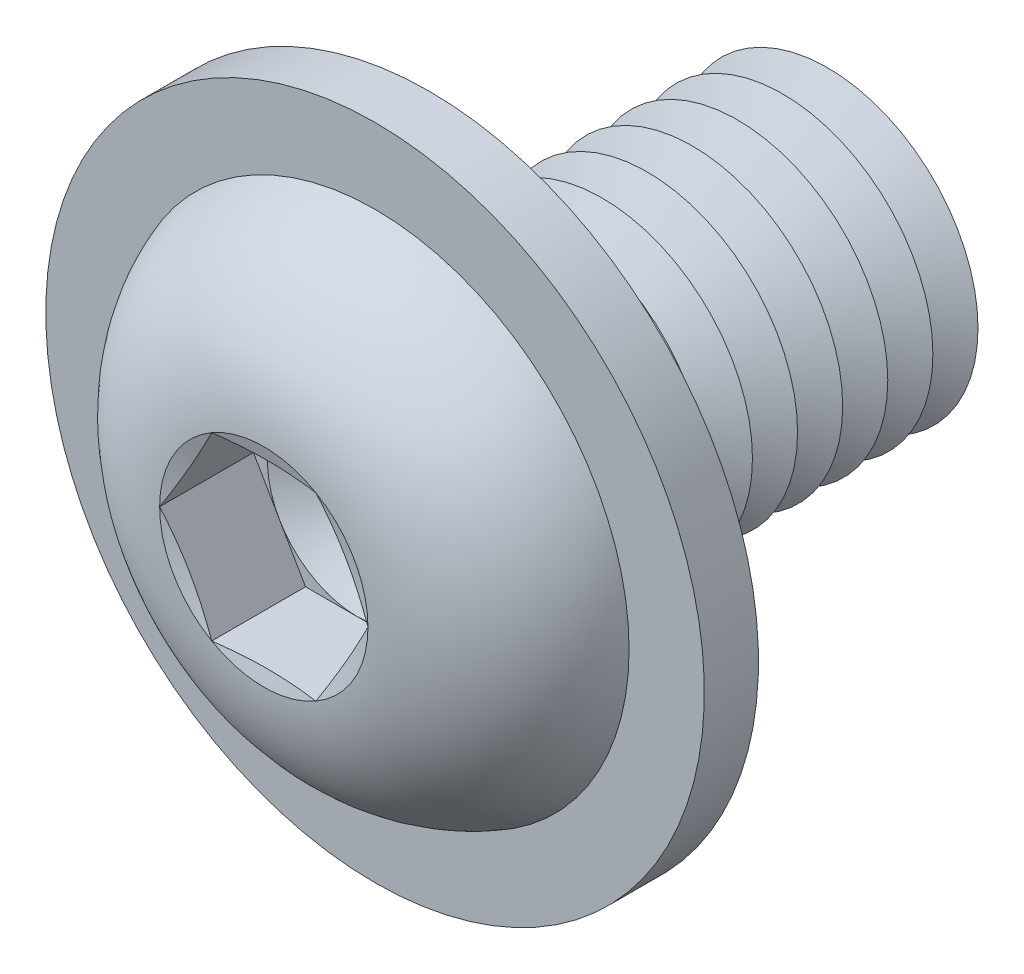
from build123d import *

# Parameters (mm, degrees)
FILLET1_R           = 0.75
LPATTERN1_COUNT     = 9
LPATTERN1_PITCH     = 1.5
CUT_EXTRUDE1_DEPTH  = 3.12
SKETCH5_R           = 10.95
SKETCH5_R_2         = 5.75
BOSS_EXTRUDE1_DEPTH = 1.8


with BuildPart() as part:
    # Sketch1 → Revolve1 (revolve)
    with BuildSketch(Plane(origin=(0, 0, 0), x_dir=(0, 0, -1), z_dir=(1, 0, 0)), mode=Mode.PRIVATE) as revolve1_sk:
        with BuildLine():
            Line((0, 5), (0, 8.75))
            ThreePointArc((0, 8.75), (-3.814142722, 7.21429474), (-5.5, 3.4641))
            Line((-5.5, 3.4641), (-5.035898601, 1.73205))
            Line((-5.035898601, 1.73205), (-5.5, 1.73205))
            Line((-5.5, 1.73205), (-5.5, 0))
            Line((-5.5, 0), (14, 0))
            Line((14, 0), (14, 5))
            Line((14, 5), (0, 5))
        make_face()
    revolve(revolve1_sk.sketch.rotate(Axis((0, 0, -14), (0, 0, 1)), 90), axis=Axis((0, 0, -14), (0, 0, 1)))

    # Fillet1
    fillet1_edges = [part.edges().sort_by_distance(p)[0] for p in [
        (5, 0, 0),
    ]]
    fillet(fillet1_edges, radius=FILLET1_R)

    # Sketch2 → Cut-Revolve1 (revolve, cut)
    with BuildSketch(Plane(origin=(0, 0, 0), x_dir=(0, 0, -1), z_dir=(1, 0, 0)), mode=Mode.PRIVATE) as cut_revolve1_sk:
        Polygon((13.25, 5), (14.75, 5), (14, 3.700961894), align=None)
    cut_revolve1 = revolve(cut_revolve1_sk.sketch.rotate(Axis((0, 0, -14), (0, 0, -1)), 270), axis=Axis((0, 0, -14), (0, 0, -1)), mode=Mode.SUBTRACT)

    # LPattern1: Cut-Revolve1 ×9
    with Locations(*[(0, 0, i * LPATTERN1_PITCH) for i in range(1, LPATTERN1_COUNT)]):
        add(cut_revolve1, mode=Mode.SUBTRACT)

    # Sketch3 → Cut-Extrude1 (cut)
    with BuildSketch(Plane.XY.offset(5.5)):
        Polygon((1.73205, 2.999998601), (-1.73205, 2.999998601), (-3.4641, 0), (-1.73205, -2.999998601), (1.73205, -2.999998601), (3.4641, 0), align=None)
    extrude(amount=-CUT_EXTRUDE1_DEPTH, mode=Mode.SUBTRACT)

    # Cut-Extrude2 cone 1 section (on through the dimple's axis) → Cut-Extrude2 (revolve, cut)
    with BuildSketch(Plane(origin=(0, 0, 2.38), x_dir=(0, -1, 0), z_dir=(1, 0, 0))):
        Polygon((0, 0), (2.999998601, 0), (0, 1.73205), align=None)
    revolve(axis=Axis((0, 0, 2.38), (0, 0, -1)), mode=Mode.SUBTRACT)

    # Sketch5 → Boss-Extrude1 (add)
    with BuildSketch(Plane(origin=(0, 0, 0), x_dir=(-1, 0, 0), z_dir=(0, 0, -1))):
        with Locations(Location((0, 0, 0), (0, 0, 90))):
            Circle(SKETCH5_R)
        Circle(SKETCH5_R_2, mode=Mode.SUBTRACT)
    extrude(amount=-BOSS_EXTRUDE1_DEPTH)


solid = part.part
